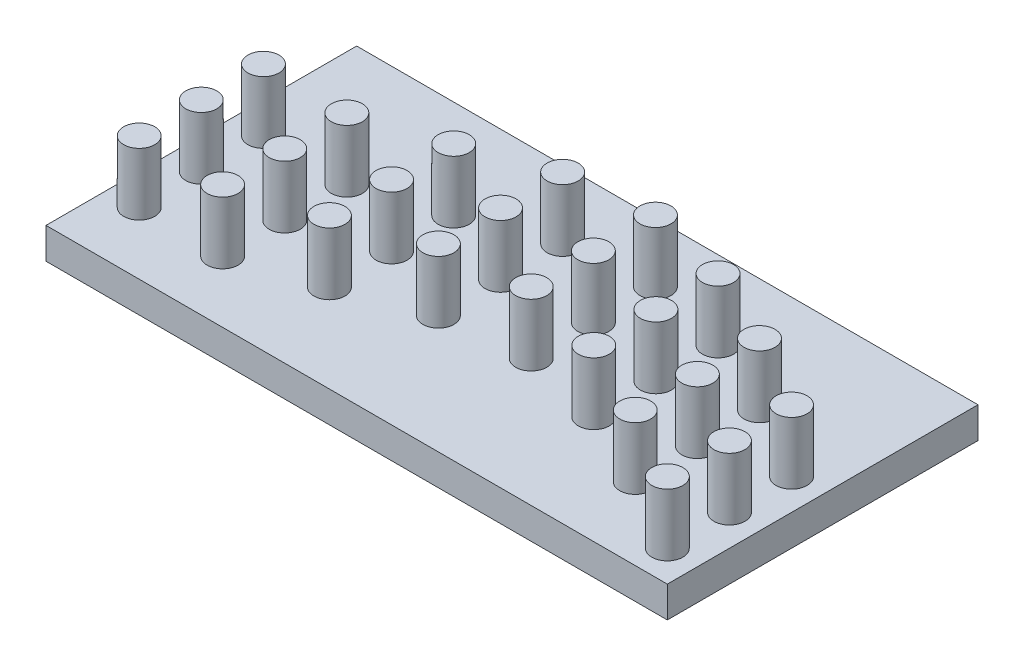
ISO-10303-21;
HEADER;
FILE_DESCRIPTION(('STEP AP214'),'2;1');
FILE_NAME('part.step','',(''),(''),'','','');
FILE_SCHEMA(('AUTOMOTIVE_DESIGN { 1 0 10303 214 1 1 1 1 }'));
ENDSEC;
DATA;
#1=APPLICATION_CONTEXT('core data for automotive mechanical design processes');
#2=APPLICATION_PROTOCOL_DEFINITION('international standard','automotive_design',2000,#1);
#3=PRODUCT_CONTEXT('',#1,'mechanical');
#4=PRODUCT('Part','Part','',(#3));
#5=PRODUCT_RELATED_PRODUCT_CATEGORY('part','',(#4));
#6=PRODUCT_DEFINITION_FORMATION('','',#4);
#7=PRODUCT_DEFINITION_CONTEXT('part definition',#1,'design');
#8=PRODUCT_DEFINITION('design','',#6,#7);
#9=PRODUCT_DEFINITION_SHAPE('','',#8);
#10=(LENGTH_UNIT() NAMED_UNIT(*) SI_UNIT(.MILLI.,.METRE.));
#11=(NAMED_UNIT(*) PLANE_ANGLE_UNIT() SI_UNIT($,.RADIAN.));
#12=(NAMED_UNIT(*) SI_UNIT($,.STERADIAN.) SOLID_ANGLE_UNIT());
#13=UNCERTAINTY_MEASURE_WITH_UNIT(LENGTH_MEASURE(1.E-05),#10,'distance_accuracy_value','');
#14=(GEOMETRIC_REPRESENTATION_CONTEXT(3) GLOBAL_UNCERTAINTY_ASSIGNED_CONTEXT((#13)) GLOBAL_UNIT_ASSIGNED_CONTEXT((#10,
#11,#12)) REPRESENTATION_CONTEXT('',''));
#15=CARTESIAN_POINT('',(0.,0.,0.));
#16=DIRECTION('',(0.,0.,1.));
#17=DIRECTION('',(1.,0.,0.));
#18=AXIS2_PLACEMENT_3D('',#15,#16,#17);
#19=CARTESIAN_POINT('',(0.,5.,-50.));
#20=DIRECTION('',(0.,-1.,0.));
#21=DIRECTION('',(0.,0.,-1.));
#22=AXIS2_PLACEMENT_3D('',#19,#20,#21);
#23=PLANE('',#22);
#24=CARTESIAN_POINT('',(5.,5.,-19.99755859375));
#25=DIRECTION('',(0.,-1.,0.));
#26=DIRECTION('',(0.,0.,-1.));
#27=AXIS2_PLACEMENT_3D('',#24,#25,#26);
#28=CIRCLE('',#27,2.5);
#29=CARTESIAN_POINT('',(5.,5.,-22.49755859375));
#30=VERTEX_POINT('',#29);
#31=EDGE_CURVE('E44',#30,#30,#28,.F.);
#32=ORIENTED_EDGE('',*,*,#31,.F.);
#33=EDGE_LOOP('',(#32));
#34=FACE_BOUND('',#33,.T.);
#35=CARTESIAN_POINT('',(18.5076552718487,5.,-29.9126254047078));
#36=DIRECTION('',(0.,-1.,0.));
#37=DIRECTION('',(0.,0.,-1.));
#38=AXIS2_PLACEMENT_3D('',#35,#36,#37);
#39=CIRCLE('',#38,2.5);
#40=CARTESIAN_POINT('',(18.5076552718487,5.,-32.4126254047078));
#41=VERTEX_POINT('',#40);
#42=EDGE_CURVE('E178',#41,#41,#39,.F.);
#43=ORIENTED_EDGE('',*,*,#42,.F.);
#44=EDGE_LOOP('',(#43));
#45=FACE_BOUND('',#44,.T.);
#46=CARTESIAN_POINT('',(18.5076552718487,5.,-9.91750821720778));
#47=DIRECTION('',(0.,-1.,0.));
#48=DIRECTION('',(0.,0.,-1.));
#49=AXIS2_PLACEMENT_3D('',#46,#47,#48);
#50=CIRCLE('',#49,2.5);
#51=CARTESIAN_POINT('',(18.5076552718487,5.,-12.4175082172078));
#52=VERTEX_POINT('',#51);
#53=EDGE_CURVE('E172',#52,#52,#50,.F.);
#54=ORIENTED_EDGE('',*,*,#53,.F.);
#55=EDGE_LOOP('',(#54));
#56=FACE_BOUND('',#55,.T.);
#57=CARTESIAN_POINT('',(31.4104140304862,5.,-24.2070037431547));
#58=DIRECTION('',(0.,-1.,0.));
#59=DIRECTION('',(0.,0.,-1.));
#60=AXIS2_PLACEMENT_3D('',#57,#58,#59);
#61=CIRCLE('',#60,2.5);
#62=CARTESIAN_POINT('',(31.4104140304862,5.,-26.7070037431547));
#63=VERTEX_POINT('',#62);
#64=EDGE_CURVE('E166',#63,#63,#61,.F.);
#65=ORIENTED_EDGE('',*,*,#64,.F.);
#66=EDGE_LOOP('',(#65));
#67=FACE_BOUND('',#66,.T.);
#68=CARTESIAN_POINT('',(44.1361143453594,5.,-39.0157945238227));
#69=DIRECTION('',(0.,-1.,0.));
#70=DIRECTION('',(0.,0.,-1.));
#71=AXIS2_PLACEMENT_3D('',#68,#69,#70);
#72=CIRCLE('',#71,2.5);
#73=CARTESIAN_POINT('',(44.1361143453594,5.,-41.5157945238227));
#74=VERTEX_POINT('',#73);
#75=EDGE_CURVE('E160',#74,#74,#72,.F.);
#76=ORIENTED_EDGE('',*,*,#75,.F.);
#77=EDGE_LOOP('',(#76));
#78=FACE_BOUND('',#77,.T.);
#79=CARTESIAN_POINT('',(44.1361143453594,5.,-19.0206773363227));
#80=DIRECTION('',(0.,-1.,0.));
#81=DIRECTION('',(0.,0.,-1.));
#82=AXIS2_PLACEMENT_3D('',#79,#80,#81);
#83=CIRCLE('',#82,2.5);
#84=CARTESIAN_POINT('',(44.1361143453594,5.,-21.5206773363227));
#85=VERTEX_POINT('',#84);
#86=EDGE_CURVE('E154',#85,#85,#83,.F.);
#87=ORIENTED_EDGE('',*,*,#86,.F.);
#88=EDGE_LOOP('',(#87));
#89=FACE_BOUND('',#88,.T.);
#90=CARTESIAN_POINT('',(57.5808907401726,5.,-30.5124052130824));
#91=DIRECTION('',(0.,-1.,0.));
#92=DIRECTION('',(0.,0.,-1.));
#93=AXIS2_PLACEMENT_3D('',#90,#91,#92);
#94=CIRCLE('',#93,2.5);
#95=CARTESIAN_POINT('',(57.5808907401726,5.,-33.0124052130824));
#96=VERTEX_POINT('',#95);
#97=EDGE_CURVE('E148',#96,#96,#94,.F.);
#98=ORIENTED_EDGE('',*,*,#97,.F.);
#99=EDGE_LOOP('',(#98));
#100=FACE_BOUND('',#99,.T.);
#101=CARTESIAN_POINT('',(70.7857795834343,5.,-37.373901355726));
#102=DIRECTION('',(0.,-1.,0.));
#103=DIRECTION('',(0.,0.,-1.));
#104=AXIS2_PLACEMENT_3D('',#101,#102,#103);
#105=CIRCLE('',#104,2.5);
#106=CARTESIAN_POINT('',(70.7857795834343,5.,-39.873901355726));
#107=VERTEX_POINT('',#106);
#108=EDGE_CURVE('E142',#107,#107,#105,.F.);
#109=ORIENTED_EDGE('',*,*,#108,.F.);
#110=EDGE_LOOP('',(#109));
#111=FACE_BOUND('',#110,.T.);
#112=CARTESIAN_POINT('',(70.7857795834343,5.,-17.378784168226));
#113=DIRECTION('',(0.,-1.,0.));
#114=DIRECTION('',(0.,0.,-1.));
#115=AXIS2_PLACEMENT_3D('',#112,#113,#114);
#116=CIRCLE('',#115,2.5);
#117=CARTESIAN_POINT('',(70.7857795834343,5.,-19.878784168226));
#118=VERTEX_POINT('',#117);
#119=EDGE_CURVE('E136',#118,#118,#116,.F.);
#120=ORIENTED_EDGE('',*,*,#119,.F.);
#121=EDGE_LOOP('',(#120));
#122=FACE_BOUND('',#121,.T.);
#123=CARTESIAN_POINT('',(83.1511721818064,5.,-21.683277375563));
#124=DIRECTION('',(0.,-1.,0.));
#125=DIRECTION('',(0.,0.,-1.));
#126=AXIS2_PLACEMENT_3D('',#123,#124,#125);
#127=CIRCLE('',#126,2.5);
#128=CARTESIAN_POINT('',(83.1511721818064,5.,-24.1832773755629));
#129=VERTEX_POINT('',#128);
#130=EDGE_CURVE('E130',#129,#129,#127,.F.);
#131=ORIENTED_EDGE('',*,*,#130,.F.);
#132=EDGE_LOOP('',(#131));
#133=FACE_BOUND('',#132,.T.);
#134=CARTESIAN_POINT('',(95.,5.,-24.9951171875));
#135=DIRECTION('',(0.,-1.,0.));
#136=DIRECTION('',(0.,0.,-1.));
#137=AXIS2_PLACEMENT_3D('',#134,#135,#136);
#138=CIRCLE('',#137,2.5);
#139=CARTESIAN_POINT('',(95.,5.,-27.4951171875));
#140=VERTEX_POINT('',#139);
#141=EDGE_CURVE('E124',#140,#140,#138,.F.);
#142=ORIENTED_EDGE('',*,*,#141,.F.);
#143=EDGE_LOOP('',(#142));
#144=FACE_BOUND('',#143,.T.);
#145=CARTESIAN_POINT('',(95.,5.,-5.));
#146=DIRECTION('',(0.,-1.,0.));
#147=DIRECTION('',(0.,0.,-1.));
#148=AXIS2_PLACEMENT_3D('',#145,#146,#147);
#149=CIRCLE('',#148,2.5);
#150=CARTESIAN_POINT('',(95.,5.,-7.5));
#151=VERTEX_POINT('',#150);
#152=EDGE_CURVE('E94',#151,#151,#149,.F.);
#153=ORIENTED_EDGE('',*,*,#152,.F.);
#154=EDGE_LOOP('',(#153));
#155=FACE_BOUND('',#154,.T.);
#156=DIRECTION('',(0.,0.,1.));
#157=VECTOR('',#156,1.);
#158=CARTESIAN_POINT('',(0.,5.,0.));
#159=LINE('',#158,#157);
#160=CARTESIAN_POINT('',(0.,5.,-50.));
#161=VERTEX_POINT('',#160);
#162=CARTESIAN_POINT('',(0.,5.,0.));
#163=VERTEX_POINT('',#162);
#164=EDGE_CURVE('E109',#161,#163,#159,.T.);
#165=ORIENTED_EDGE('',*,*,#164,.T.);
#166=DIRECTION('',(1.,0.,0.));
#167=VECTOR('',#166,1.);
#168=CARTESIAN_POINT('',(0.,5.,0.));
#169=LINE('',#168,#167);
#170=CARTESIAN_POINT('',(100.,5.,0.));
#171=VERTEX_POINT('',#170);
#172=EDGE_CURVE('E91',#163,#171,#169,.T.);
#173=ORIENTED_EDGE('',*,*,#172,.T.);
#174=DIRECTION('',(0.,0.,-1.));
#175=VECTOR('',#174,1.);
#176=CARTESIAN_POINT('',(100.,5.,0.));
#177=LINE('',#176,#175);
#178=CARTESIAN_POINT('',(100.,5.,-50.));
#179=VERTEX_POINT('',#178);
#180=EDGE_CURVE('E56',#171,#179,#177,.T.);
#181=ORIENTED_EDGE('',*,*,#180,.T.);
#182=DIRECTION('',(-1.,0.,0.));
#183=VECTOR('',#182,1.);
#184=CARTESIAN_POINT('',(0.,5.,-50.));
#185=LINE('',#184,#183);
#186=EDGE_CURVE('E51',#179,#161,#185,.T.);
#187=ORIENTED_EDGE('',*,*,#186,.T.);
#188=EDGE_LOOP('',(#165,#173,#181,#187));
#189=FACE_BOUND('',#188,.T.);
#190=CARTESIAN_POINT('',(95.,5.,-14.99755859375));
#191=DIRECTION('',(0.,-1.,0.));
#192=DIRECTION('',(0.,0.,-1.));
#193=AXIS2_PLACEMENT_3D('',#190,#191,#192);
#194=CIRCLE('',#193,2.5);
#195=CARTESIAN_POINT('',(95.,5.,-17.49755859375));
#196=VERTEX_POINT('',#195);
#197=EDGE_CURVE('E121',#196,#196,#194,.F.);
#198=ORIENTED_EDGE('',*,*,#197,.F.);
#199=EDGE_LOOP('',(#198));
#200=FACE_BOUND('',#199,.T.);
#201=CARTESIAN_POINT('',(83.1511721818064,5.,-11.6857187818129));
#202=DIRECTION('',(0.,-1.,0.));
#203=DIRECTION('',(0.,0.,-1.));
#204=AXIS2_PLACEMENT_3D('',#201,#202,#203);
#205=CIRCLE('',#204,2.5);
#206=CARTESIAN_POINT('',(83.1511721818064,5.,-14.1857187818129));
#207=VERTEX_POINT('',#206);
#208=EDGE_CURVE('E127',#207,#207,#205,.F.);
#209=ORIENTED_EDGE('',*,*,#208,.F.);
#210=EDGE_LOOP('',(#209));
#211=FACE_BOUND('',#210,.T.);
#212=CARTESIAN_POINT('',(83.1511721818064,5.,-31.680835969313));
#213=DIRECTION('',(0.,-1.,0.));
#214=DIRECTION('',(0.,0.,-1.));
#215=AXIS2_PLACEMENT_3D('',#212,#213,#214);
#216=CIRCLE('',#215,2.5);
#217=CARTESIAN_POINT('',(83.1511721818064,5.,-34.180835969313));
#218=VERTEX_POINT('',#217);
#219=EDGE_CURVE('E133',#218,#218,#216,.F.);
#220=ORIENTED_EDGE('',*,*,#219,.F.);
#221=EDGE_LOOP('',(#220));
#222=FACE_BOUND('',#221,.T.);
#223=CARTESIAN_POINT('',(70.7857795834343,5.,-27.376342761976));
#224=DIRECTION('',(0.,-1.,0.));
#225=DIRECTION('',(0.,0.,-1.));
#226=AXIS2_PLACEMENT_3D('',#223,#224,#225);
#227=CIRCLE('',#226,2.5);
#228=CARTESIAN_POINT('',(70.7857795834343,5.,-29.876342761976));
#229=VERTEX_POINT('',#228);
#230=EDGE_CURVE('E139',#229,#229,#227,.F.);
#231=ORIENTED_EDGE('',*,*,#230,.F.);
#232=EDGE_LOOP('',(#231));
#233=FACE_BOUND('',#232,.T.);
#234=CARTESIAN_POINT('',(57.5808907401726,5.,-20.5148466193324));
#235=DIRECTION('',(0.,-1.,0.));
#236=DIRECTION('',(0.,0.,-1.));
#237=AXIS2_PLACEMENT_3D('',#234,#235,#236);
#238=CIRCLE('',#237,2.5);
#239=CARTESIAN_POINT('',(57.5808907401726,5.,-23.0148466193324));
#240=VERTEX_POINT('',#239);
#241=EDGE_CURVE('E145',#240,#240,#238,.F.);
#242=ORIENTED_EDGE('',*,*,#241,.F.);
#243=EDGE_LOOP('',(#242));
#244=FACE_BOUND('',#243,.T.);
#245=CARTESIAN_POINT('',(57.5808907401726,5.,-40.5099638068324));
#246=DIRECTION('',(0.,-1.,0.));
#247=DIRECTION('',(0.,0.,-1.));
#248=AXIS2_PLACEMENT_3D('',#245,#246,#247);
#249=CIRCLE('',#248,2.5);
#250=CARTESIAN_POINT('',(57.5808907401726,5.,-43.0099638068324));
#251=VERTEX_POINT('',#250);
#252=EDGE_CURVE('E151',#251,#251,#249,.F.);
#253=ORIENTED_EDGE('',*,*,#252,.F.);
#254=EDGE_LOOP('',(#253));
#255=FACE_BOUND('',#254,.T.);
#256=CARTESIAN_POINT('',(44.1361143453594,5.,-29.0182359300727));
#257=DIRECTION('',(0.,-1.,0.));
#258=DIRECTION('',(0.,0.,-1.));
#259=AXIS2_PLACEMENT_3D('',#256,#257,#258);
#260=CIRCLE('',#259,2.5);
#261=CARTESIAN_POINT('',(44.1361143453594,5.,-31.5182359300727));
#262=VERTEX_POINT('',#261);
#263=EDGE_CURVE('E157',#262,#262,#260,.F.);
#264=ORIENTED_EDGE('',*,*,#263,.F.);
#265=EDGE_LOOP('',(#264));
#266=FACE_BOUND('',#265,.T.);
#267=CARTESIAN_POINT('',(31.4104140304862,5.,-14.2094451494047));
#268=DIRECTION('',(0.,-1.,0.));
#269=DIRECTION('',(0.,0.,-1.));
#270=AXIS2_PLACEMENT_3D('',#267,#268,#269);
#271=CIRCLE('',#270,2.5);
#272=CARTESIAN_POINT('',(31.4104140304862,5.,-16.7094451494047));
#273=VERTEX_POINT('',#272);
#274=EDGE_CURVE('E163',#273,#273,#271,.F.);
#275=ORIENTED_EDGE('',*,*,#274,.F.);
#276=EDGE_LOOP('',(#275));
#277=FACE_BOUND('',#276,.T.);
#278=CARTESIAN_POINT('',(31.4104140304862,5.,-34.2045623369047));
#279=DIRECTION('',(0.,-1.,0.));
#280=DIRECTION('',(0.,0.,-1.));
#281=AXIS2_PLACEMENT_3D('',#278,#279,#280);
#282=CIRCLE('',#281,2.5);
#283=CARTESIAN_POINT('',(31.4104140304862,5.,-36.7045623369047));
#284=VERTEX_POINT('',#283);
#285=EDGE_CURVE('E169',#284,#284,#282,.F.);
#286=ORIENTED_EDGE('',*,*,#285,.F.);
#287=EDGE_LOOP('',(#286));
#288=FACE_BOUND('',#287,.T.);
#289=CARTESIAN_POINT('',(18.5076552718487,5.,-19.9150668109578));
#290=DIRECTION('',(0.,-1.,0.));
#291=DIRECTION('',(0.,0.,-1.));
#292=AXIS2_PLACEMENT_3D('',#289,#290,#291);
#293=CIRCLE('',#292,2.5);
#294=CARTESIAN_POINT('',(18.5076552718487,5.,-22.4150668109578));
#295=VERTEX_POINT('',#294);
#296=EDGE_CURVE('E175',#295,#295,#293,.F.);
#297=ORIENTED_EDGE('',*,*,#296,.F.);
#298=EDGE_LOOP('',(#297));
#299=FACE_BOUND('',#298,.T.);
#300=CARTESIAN_POINT('',(5.,5.,-10.));
#301=DIRECTION('',(0.,-1.,0.));
#302=DIRECTION('',(0.,0.,-1.));
#303=AXIS2_PLACEMENT_3D('',#300,#301,#302);
#304=CIRCLE('',#303,2.5);
#305=CARTESIAN_POINT('',(5.,5.,-12.5));
#306=VERTEX_POINT('',#305);
#307=EDGE_CURVE('E181',#306,#306,#304,.F.);
#308=ORIENTED_EDGE('',*,*,#307,.F.);
#309=EDGE_LOOP('',(#308));
#310=FACE_BOUND('',#309,.T.);
#311=CARTESIAN_POINT('',(5.,5.,-29.9951171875));
#312=DIRECTION('',(0.,-1.,0.));
#313=DIRECTION('',(0.,0.,-1.));
#314=AXIS2_PLACEMENT_3D('',#311,#312,#313);
#315=CIRCLE('',#314,2.5);
#316=CARTESIAN_POINT('',(5.,5.,-32.4951171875));
#317=VERTEX_POINT('',#316);
#318=EDGE_CURVE('E12',#317,#317,#315,.F.);
#319=ORIENTED_EDGE('',*,*,#318,.F.);
#320=EDGE_LOOP('',(#319));
#321=FACE_BOUND('',#320,.T.);
#322=ADVANCED_FACE('F36',(#34,#45,#56,#67,#78,#89,#100,#111,#122,#133,#144,#155,#189,#200,#211,
#222,#233,#244,#255,#266,#277,#288,#299,#310,#321),#23,.F.);
#323=CARTESIAN_POINT('',(0.,5.,0.));
#324=DIRECTION('',(1.,0.,0.));
#325=DIRECTION('',(0.,0.,-1.));
#326=AXIS2_PLACEMENT_3D('',#323,#324,#325);
#327=PLANE('',#326);
#328=DIRECTION('',(0.,0.,1.));
#329=VECTOR('',#328,1.);
#330=CARTESIAN_POINT('',(0.,0.,0.));
#331=LINE('',#330,#329);
#332=CARTESIAN_POINT('',(0.,0.,-50.));
#333=VERTEX_POINT('',#332);
#334=CARTESIAN_POINT('',(0.,0.,0.));
#335=VERTEX_POINT('',#334);
#336=EDGE_CURVE('E82',#333,#335,#331,.T.);
#337=ORIENTED_EDGE('',*,*,#336,.T.);
#338=DIRECTION('',(0.,-1.,0.));
#339=VECTOR('',#338,1.);
#340=CARTESIAN_POINT('',(0.,5.,0.));
#341=LINE('',#340,#339);
#342=EDGE_CURVE('E89',#163,#335,#341,.T.);
#343=ORIENTED_EDGE('',*,*,#342,.F.);
#344=ORIENTED_EDGE('',*,*,#164,.F.);
#345=DIRECTION('',(0.,-1.,0.));
#346=VECTOR('',#345,1.);
#347=CARTESIAN_POINT('',(0.,5.,-50.));
#348=LINE('',#347,#346);
#349=EDGE_CURVE('E98',#161,#333,#348,.T.);
#350=ORIENTED_EDGE('',*,*,#349,.T.);
#351=EDGE_LOOP('',(#337,#343,#344,#350));
#352=FACE_BOUND('',#351,.T.);
#353=ADVANCED_FACE('F38',(#352),#327,.F.);
#354=CARTESIAN_POINT('',(0.,5.,0.));
#355=DIRECTION('',(0.,0.,-1.));
#356=DIRECTION('',(-1.,0.,0.));
#357=AXIS2_PLACEMENT_3D('',#354,#355,#356);
#358=PLANE('',#357);
#359=DIRECTION('',(1.,0.,0.));
#360=VECTOR('',#359,1.);
#361=CARTESIAN_POINT('',(0.,0.,0.));
#362=LINE('',#361,#360);
#363=CARTESIAN_POINT('',(100.,0.,0.));
#364=VERTEX_POINT('',#363);
#365=EDGE_CURVE('E77',#335,#364,#362,.T.);
#366=ORIENTED_EDGE('',*,*,#365,.T.);
#367=DIRECTION('',(0.,-1.,0.));
#368=VECTOR('',#367,1.);
#369=CARTESIAN_POINT('',(100.,5.,0.));
#370=LINE('',#369,#368);
#371=EDGE_CURVE('E95',#171,#364,#370,.T.);
#372=ORIENTED_EDGE('',*,*,#371,.F.);
#373=ORIENTED_EDGE('',*,*,#172,.F.);
#374=ORIENTED_EDGE('',*,*,#342,.T.);
#375=EDGE_LOOP('',(#366,#372,#373,#374));
#376=FACE_BOUND('',#375,.T.);
#377=ADVANCED_FACE('F90',(#376),#358,.F.);
#378=CARTESIAN_POINT('',(100.,5.,0.));
#379=DIRECTION('',(-1.,0.,0.));
#380=DIRECTION('',(0.,0.,1.));
#381=AXIS2_PLACEMENT_3D('',#378,#379,#380);
#382=PLANE('',#381);
#383=DIRECTION('',(0.,0.,-1.));
#384=VECTOR('',#383,1.);
#385=CARTESIAN_POINT('',(100.,0.,0.));
#386=LINE('',#385,#384);
#387=CARTESIAN_POINT('',(100.,0.,-50.));
#388=VERTEX_POINT('',#387);
#389=EDGE_CURVE('E83',#364,#388,#386,.T.);
#390=ORIENTED_EDGE('',*,*,#389,.T.);
#391=DIRECTION('',(0.,-1.,0.));
#392=VECTOR('',#391,1.);
#393=CARTESIAN_POINT('',(100.,5.,-50.));
#394=LINE('',#393,#392);
#395=EDGE_CURVE('E115',#179,#388,#394,.T.);
#396=ORIENTED_EDGE('',*,*,#395,.F.);
#397=ORIENTED_EDGE('',*,*,#180,.F.);
#398=ORIENTED_EDGE('',*,*,#371,.T.);
#399=EDGE_LOOP('',(#390,#396,#397,#398));
#400=FACE_BOUND('',#399,.T.);
#401=ADVANCED_FACE('F437',(#400),#382,.F.);
#402=CARTESIAN_POINT('',(0.,5.,-50.));
#403=DIRECTION('',(0.,0.,1.));
#404=DIRECTION('',(1.,0.,0.));
#405=AXIS2_PLACEMENT_3D('',#402,#403,#404);
#406=PLANE('',#405);
#407=DIRECTION('',(-1.,0.,0.));
#408=VECTOR('',#407,1.);
#409=CARTESIAN_POINT('',(0.,0.,-50.));
#410=LINE('',#409,#408);
#411=EDGE_CURVE('E107',#388,#333,#410,.T.);
#412=ORIENTED_EDGE('',*,*,#411,.T.);
#413=ORIENTED_EDGE('',*,*,#349,.F.);
#414=ORIENTED_EDGE('',*,*,#186,.F.);
#415=ORIENTED_EDGE('',*,*,#395,.T.);
#416=EDGE_LOOP('',(#412,#413,#414,#415));
#417=FACE_BOUND('',#416,.T.);
#418=ADVANCED_FACE('F433',(#417),#406,.F.);
#419=CARTESIAN_POINT('',(0.,0.,-50.));
#420=DIRECTION('',(0.,-1.,0.));
#421=DIRECTION('',(0.,0.,-1.));
#422=AXIS2_PLACEMENT_3D('',#419,#420,#421);
#423=PLANE('',#422);
#424=ORIENTED_EDGE('',*,*,#336,.F.);
#425=ORIENTED_EDGE('',*,*,#411,.F.);
#426=ORIENTED_EDGE('',*,*,#389,.F.);
#427=ORIENTED_EDGE('',*,*,#365,.F.);
#428=EDGE_LOOP('',(#424,#425,#426,#427));
#429=FACE_BOUND('',#428,.T.);
#430=ADVANCED_FACE('F79',(#429),#423,.T.);
#431=CARTESIAN_POINT('',(95.,15.,-5.));
#432=DIRECTION('',(0.,-1.,0.));
#433=DIRECTION('',(0.,0.,-1.));
#434=AXIS2_PLACEMENT_3D('',#431,#432,#433);
#435=CYLINDRICAL_SURFACE('',#434,2.5);
#436=CARTESIAN_POINT('',(95.,15.,-5.));
#437=DIRECTION('',(0.,1.,0.));
#438=DIRECTION('',(0.,0.,1.));
#439=AXIS2_PLACEMENT_3D('',#436,#437,#438);
#440=CIRCLE('',#439,2.5);
#441=CARTESIAN_POINT('',(95.,15.,-2.5));
#442=VERTEX_POINT('',#441);
#443=EDGE_CURVE('E99',#442,#442,#440,.T.);
#444=ORIENTED_EDGE('',*,*,#443,.F.);
#445=EDGE_LOOP('',(#444));
#446=FACE_BOUND('',#445,.T.);
#447=ORIENTED_EDGE('',*,*,#152,.T.);
#448=EDGE_LOOP('',(#447));
#449=FACE_BOUND('',#448,.T.);
#450=ADVANCED_FACE('F427',(#446,#449),#435,.T.);
#451=CARTESIAN_POINT('',(95.,15.,-5.));
#452=DIRECTION('',(0.,1.,0.));
#453=DIRECTION('',(0.,0.,1.));
#454=AXIS2_PLACEMENT_3D('',#451,#452,#453);
#455=PLANE('',#454);
#456=ORIENTED_EDGE('',*,*,#443,.T.);
#457=EDGE_LOOP('',(#456));
#458=FACE_BOUND('',#457,.T.);
#459=ADVANCED_FACE('F423',(#458),#455,.T.);
#460=CARTESIAN_POINT('',(95.,15.,-14.99755859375));
#461=DIRECTION('',(0.,-1.,0.));
#462=DIRECTION('',(0.,0.,-1.));
#463=AXIS2_PLACEMENT_3D('',#460,#461,#462);
#464=CYLINDRICAL_SURFACE('',#463,2.5);
#465=CARTESIAN_POINT('',(95.,15.,-14.99755859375));
#466=DIRECTION('',(0.,1.,0.));
#467=DIRECTION('',(0.,0.,1.));
#468=AXIS2_PLACEMENT_3D('',#465,#466,#467);
#469=CIRCLE('',#468,2.5);
#470=CARTESIAN_POINT('',(95.,15.,-12.49755859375));
#471=VERTEX_POINT('',#470);
#472=EDGE_CURVE('E102',#471,#471,#469,.T.);
#473=ORIENTED_EDGE('',*,*,#472,.F.);
#474=EDGE_LOOP('',(#473));
#475=FACE_BOUND('',#474,.T.);
#476=ORIENTED_EDGE('',*,*,#197,.T.);
#477=EDGE_LOOP('',(#476));
#478=FACE_BOUND('',#477,.T.);
#479=ADVANCED_FACE('F419',(#475,#478),#464,.T.);
#480=CARTESIAN_POINT('',(95.,15.,-14.99755859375));
#481=DIRECTION('',(0.,1.,0.));
#482=DIRECTION('',(0.,0.,1.));
#483=AXIS2_PLACEMENT_3D('',#480,#481,#482);
#484=PLANE('',#483);
#485=ORIENTED_EDGE('',*,*,#472,.T.);
#486=EDGE_LOOP('',(#485));
#487=FACE_BOUND('',#486,.T.);
#488=ADVANCED_FACE('F415',(#487),#484,.T.);
#489=CARTESIAN_POINT('',(95.,15.,-24.9951171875));
#490=DIRECTION('',(0.,-1.,0.));
#491=DIRECTION('',(0.,0.,-1.));
#492=AXIS2_PLACEMENT_3D('',#489,#490,#491);
#493=CYLINDRICAL_SURFACE('',#492,2.5);
#494=CARTESIAN_POINT('',(95.,15.,-24.9951171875));
#495=DIRECTION('',(0.,1.,0.));
#496=DIRECTION('',(0.,0.,1.));
#497=AXIS2_PLACEMENT_3D('',#494,#495,#496);
#498=CIRCLE('',#497,2.5);
#499=CARTESIAN_POINT('',(95.,15.,-22.4951171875));
#500=VERTEX_POINT('',#499);
#501=EDGE_CURVE('E770',#500,#500,#498,.T.);
#502=ORIENTED_EDGE('',*,*,#501,.F.);
#503=EDGE_LOOP('',(#502));
#504=FACE_BOUND('',#503,.T.);
#505=ORIENTED_EDGE('',*,*,#141,.T.);
#506=EDGE_LOOP('',(#505));
#507=FACE_BOUND('',#506,.T.);
#508=ADVANCED_FACE('F411',(#504,#507),#493,.T.);
#509=CARTESIAN_POINT('',(95.,15.,-24.9951171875));
#510=DIRECTION('',(0.,1.,0.));
#511=DIRECTION('',(0.,0.,1.));
#512=AXIS2_PLACEMENT_3D('',#509,#510,#511);
#513=PLANE('',#512);
#514=ORIENTED_EDGE('',*,*,#501,.T.);
#515=EDGE_LOOP('',(#514));
#516=FACE_BOUND('',#515,.T.);
#517=ADVANCED_FACE('F407',(#516),#513,.T.);
#518=CARTESIAN_POINT('',(83.1511721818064,15.,-11.6857187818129));
#519=DIRECTION('',(0.,-1.,0.));
#520=DIRECTION('',(0.,0.,-1.));
#521=AXIS2_PLACEMENT_3D('',#518,#519,#520);
#522=CYLINDRICAL_SURFACE('',#521,2.5);
#523=CARTESIAN_POINT('',(83.1511721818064,15.,-11.6857187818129));
#524=DIRECTION('',(0.,1.,0.));
#525=DIRECTION('',(0.,0.,1.));
#526=AXIS2_PLACEMENT_3D('',#523,#524,#525);
#527=CIRCLE('',#526,2.5);
#528=CARTESIAN_POINT('',(83.1511721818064,15.,-9.18571878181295));
#529=VERTEX_POINT('',#528);
#530=EDGE_CURVE('E772',#529,#529,#527,.T.);
#531=ORIENTED_EDGE('',*,*,#530,.F.);
#532=EDGE_LOOP('',(#531));
#533=FACE_BOUND('',#532,.T.);
#534=ORIENTED_EDGE('',*,*,#208,.T.);
#535=EDGE_LOOP('',(#534));
#536=FACE_BOUND('',#535,.T.);
#537=ADVANCED_FACE('F403',(#533,#536),#522,.T.);
#538=CARTESIAN_POINT('',(83.1511721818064,15.,-11.6857187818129));
#539=DIRECTION('',(0.,1.,0.));
#540=DIRECTION('',(0.,0.,1.));
#541=AXIS2_PLACEMENT_3D('',#538,#539,#540);
#542=PLANE('',#541);
#543=ORIENTED_EDGE('',*,*,#530,.T.);
#544=EDGE_LOOP('',(#543));
#545=FACE_BOUND('',#544,.T.);
#546=ADVANCED_FACE('F399',(#545),#542,.T.);
#547=CARTESIAN_POINT('',(83.1511721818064,15.,-21.683277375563));
#548=DIRECTION('',(0.,-1.,0.));
#549=DIRECTION('',(0.,0.,-1.));
#550=AXIS2_PLACEMENT_3D('',#547,#548,#549);
#551=CYLINDRICAL_SURFACE('',#550,2.5);
#552=CARTESIAN_POINT('',(83.1511721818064,15.,-21.683277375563));
#553=DIRECTION('',(0.,1.,0.));
#554=DIRECTION('',(0.,0.,1.));
#555=AXIS2_PLACEMENT_3D('',#552,#553,#554);
#556=CIRCLE('',#555,2.5);
#557=CARTESIAN_POINT('',(83.1511721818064,15.,-19.183277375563));
#558=VERTEX_POINT('',#557);
#559=EDGE_CURVE('E777',#558,#558,#556,.T.);
#560=ORIENTED_EDGE('',*,*,#559,.F.);
#561=EDGE_LOOP('',(#560));
#562=FACE_BOUND('',#561,.T.);
#563=ORIENTED_EDGE('',*,*,#130,.T.);
#564=EDGE_LOOP('',(#563));
#565=FACE_BOUND('',#564,.T.);
#566=ADVANCED_FACE('F395',(#562,#565),#551,.T.);
#567=CARTESIAN_POINT('',(83.1511721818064,15.,-21.683277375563));
#568=DIRECTION('',(0.,1.,0.));
#569=DIRECTION('',(0.,0.,1.));
#570=AXIS2_PLACEMENT_3D('',#567,#568,#569);
#571=PLANE('',#570);
#572=ORIENTED_EDGE('',*,*,#559,.T.);
#573=EDGE_LOOP('',(#572));
#574=FACE_BOUND('',#573,.T.);
#575=ADVANCED_FACE('F391',(#574),#571,.T.);
#576=CARTESIAN_POINT('',(83.1511721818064,15.,-31.680835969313));
#577=DIRECTION('',(0.,-1.,0.));
#578=DIRECTION('',(0.,0.,-1.));
#579=AXIS2_PLACEMENT_3D('',#576,#577,#578);
#580=CYLINDRICAL_SURFACE('',#579,2.5);
#581=CARTESIAN_POINT('',(83.1511721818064,15.,-31.680835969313));
#582=DIRECTION('',(0.,1.,0.));
#583=DIRECTION('',(0.,0.,1.));
#584=AXIS2_PLACEMENT_3D('',#581,#582,#583);
#585=CIRCLE('',#584,2.5);
#586=CARTESIAN_POINT('',(83.1511721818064,15.,-29.180835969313));
#587=VERTEX_POINT('',#586);
#588=EDGE_CURVE('E780',#587,#587,#585,.T.);
#589=ORIENTED_EDGE('',*,*,#588,.F.);
#590=EDGE_LOOP('',(#589));
#591=FACE_BOUND('',#590,.T.);
#592=ORIENTED_EDGE('',*,*,#219,.T.);
#593=EDGE_LOOP('',(#592));
#594=FACE_BOUND('',#593,.T.);
#595=ADVANCED_FACE('F387',(#591,#594),#580,.T.);
#596=CARTESIAN_POINT('',(83.1511721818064,15.,-31.680835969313));
#597=DIRECTION('',(0.,1.,0.));
#598=DIRECTION('',(0.,0.,1.));
#599=AXIS2_PLACEMENT_3D('',#596,#597,#598);
#600=PLANE('',#599);
#601=ORIENTED_EDGE('',*,*,#588,.T.);
#602=EDGE_LOOP('',(#601));
#603=FACE_BOUND('',#602,.T.);
#604=ADVANCED_FACE('F383',(#603),#600,.T.);
#605=CARTESIAN_POINT('',(70.7857795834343,15.,-17.378784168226));
#606=DIRECTION('',(0.,-1.,0.));
#607=DIRECTION('',(0.,0.,-1.));
#608=AXIS2_PLACEMENT_3D('',#605,#606,#607);
#609=CYLINDRICAL_SURFACE('',#608,2.5);
#610=CARTESIAN_POINT('',(70.7857795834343,15.,-17.378784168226));
#611=DIRECTION('',(0.,1.,0.));
#612=DIRECTION('',(0.,0.,1.));
#613=AXIS2_PLACEMENT_3D('',#610,#611,#612);
#614=CIRCLE('',#613,2.5);
#615=CARTESIAN_POINT('',(70.7857795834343,15.,-14.878784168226));
#616=VERTEX_POINT('',#615);
#617=EDGE_CURVE('E783',#616,#616,#614,.T.);
#618=ORIENTED_EDGE('',*,*,#617,.F.);
#619=EDGE_LOOP('',(#618));
#620=FACE_BOUND('',#619,.T.);
#621=ORIENTED_EDGE('',*,*,#119,.T.);
#622=EDGE_LOOP('',(#621));
#623=FACE_BOUND('',#622,.T.);
#624=ADVANCED_FACE('F379',(#620,#623),#609,.T.);
#625=CARTESIAN_POINT('',(70.7857795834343,15.,-17.378784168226));
#626=DIRECTION('',(0.,1.,0.));
#627=DIRECTION('',(0.,0.,1.));
#628=AXIS2_PLACEMENT_3D('',#625,#626,#627);
#629=PLANE('',#628);
#630=ORIENTED_EDGE('',*,*,#617,.T.);
#631=EDGE_LOOP('',(#630));
#632=FACE_BOUND('',#631,.T.);
#633=ADVANCED_FACE('F375',(#632),#629,.T.);
#634=CARTESIAN_POINT('',(70.7857795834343,15.,-27.376342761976));
#635=DIRECTION('',(0.,-1.,0.));
#636=DIRECTION('',(0.,0.,-1.));
#637=AXIS2_PLACEMENT_3D('',#634,#635,#636);
#638=CYLINDRICAL_SURFACE('',#637,2.5);
#639=CARTESIAN_POINT('',(70.7857795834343,15.,-27.376342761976));
#640=DIRECTION('',(0.,1.,0.));
#641=DIRECTION('',(0.,0.,1.));
#642=AXIS2_PLACEMENT_3D('',#639,#640,#641);
#643=CIRCLE('',#642,2.5);
#644=CARTESIAN_POINT('',(70.7857795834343,15.,-24.876342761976));
#645=VERTEX_POINT('',#644);
#646=EDGE_CURVE('E786',#645,#645,#643,.T.);
#647=ORIENTED_EDGE('',*,*,#646,.F.);
#648=EDGE_LOOP('',(#647));
#649=FACE_BOUND('',#648,.T.);
#650=ORIENTED_EDGE('',*,*,#230,.T.);
#651=EDGE_LOOP('',(#650));
#652=FACE_BOUND('',#651,.T.);
#653=ADVANCED_FACE('F371',(#649,#652),#638,.T.);
#654=CARTESIAN_POINT('',(70.7857795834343,15.,-27.376342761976));
#655=DIRECTION('',(0.,1.,0.));
#656=DIRECTION('',(0.,0.,1.));
#657=AXIS2_PLACEMENT_3D('',#654,#655,#656);
#658=PLANE('',#657);
#659=ORIENTED_EDGE('',*,*,#646,.T.);
#660=EDGE_LOOP('',(#659));
#661=FACE_BOUND('',#660,.T.);
#662=ADVANCED_FACE('F367',(#661),#658,.T.);
#663=CARTESIAN_POINT('',(70.7857795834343,15.,-37.373901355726));
#664=DIRECTION('',(0.,-1.,0.));
#665=DIRECTION('',(0.,0.,-1.));
#666=AXIS2_PLACEMENT_3D('',#663,#664,#665);
#667=CYLINDRICAL_SURFACE('',#666,2.5);
#668=CARTESIAN_POINT('',(70.7857795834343,15.,-37.373901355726));
#669=DIRECTION('',(0.,1.,0.));
#670=DIRECTION('',(0.,0.,1.));
#671=AXIS2_PLACEMENT_3D('',#668,#669,#670);
#672=CIRCLE('',#671,2.5);
#673=CARTESIAN_POINT('',(70.7857795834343,15.,-34.873901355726));
#674=VERTEX_POINT('',#673);
#675=EDGE_CURVE('E789',#674,#674,#672,.T.);
#676=ORIENTED_EDGE('',*,*,#675,.F.);
#677=EDGE_LOOP('',(#676));
#678=FACE_BOUND('',#677,.T.);
#679=ORIENTED_EDGE('',*,*,#108,.T.);
#680=EDGE_LOOP('',(#679));
#681=FACE_BOUND('',#680,.T.);
#682=ADVANCED_FACE('F363',(#678,#681),#667,.T.);
#683=CARTESIAN_POINT('',(70.7857795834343,15.,-37.373901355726));
#684=DIRECTION('',(0.,1.,0.));
#685=DIRECTION('',(0.,0.,1.));
#686=AXIS2_PLACEMENT_3D('',#683,#684,#685);
#687=PLANE('',#686);
#688=ORIENTED_EDGE('',*,*,#675,.T.);
#689=EDGE_LOOP('',(#688));
#690=FACE_BOUND('',#689,.T.);
#691=ADVANCED_FACE('F359',(#690),#687,.T.);
#692=CARTESIAN_POINT('',(57.5808907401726,15.,-20.5148466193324));
#693=DIRECTION('',(0.,-1.,0.));
#694=DIRECTION('',(0.,0.,-1.));
#695=AXIS2_PLACEMENT_3D('',#692,#693,#694);
#696=CYLINDRICAL_SURFACE('',#695,2.5);
#697=CARTESIAN_POINT('',(57.5808907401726,15.,-20.5148466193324));
#698=DIRECTION('',(0.,1.,0.));
#699=DIRECTION('',(0.,0.,1.));
#700=AXIS2_PLACEMENT_3D('',#697,#698,#699);
#701=CIRCLE('',#700,2.5);
#702=CARTESIAN_POINT('',(57.5808907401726,15.,-18.0148466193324));
#703=VERTEX_POINT('',#702);
#704=EDGE_CURVE('E792',#703,#703,#701,.T.);
#705=ORIENTED_EDGE('',*,*,#704,.F.);
#706=EDGE_LOOP('',(#705));
#707=FACE_BOUND('',#706,.T.);
#708=ORIENTED_EDGE('',*,*,#241,.T.);
#709=EDGE_LOOP('',(#708));
#710=FACE_BOUND('',#709,.T.);
#711=ADVANCED_FACE('F355',(#707,#710),#696,.T.);
#712=CARTESIAN_POINT('',(57.5808907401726,15.,-20.5148466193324));
#713=DIRECTION('',(0.,1.,0.));
#714=DIRECTION('',(0.,0.,1.));
#715=AXIS2_PLACEMENT_3D('',#712,#713,#714);
#716=PLANE('',#715);
#717=ORIENTED_EDGE('',*,*,#704,.T.);
#718=EDGE_LOOP('',(#717));
#719=FACE_BOUND('',#718,.T.);
#720=ADVANCED_FACE('F351',(#719),#716,.T.);
#721=CARTESIAN_POINT('',(57.5808907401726,15.,-30.5124052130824));
#722=DIRECTION('',(0.,-1.,0.));
#723=DIRECTION('',(0.,0.,-1.));
#724=AXIS2_PLACEMENT_3D('',#721,#722,#723);
#725=CYLINDRICAL_SURFACE('',#724,2.5);
#726=CARTESIAN_POINT('',(57.5808907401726,15.,-30.5124052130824));
#727=DIRECTION('',(0.,1.,0.));
#728=DIRECTION('',(0.,0.,1.));
#729=AXIS2_PLACEMENT_3D('',#726,#727,#728);
#730=CIRCLE('',#729,2.5);
#731=CARTESIAN_POINT('',(57.5808907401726,15.,-28.0124052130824));
#732=VERTEX_POINT('',#731);
#733=EDGE_CURVE('E795',#732,#732,#730,.T.);
#734=ORIENTED_EDGE('',*,*,#733,.F.);
#735=EDGE_LOOP('',(#734));
#736=FACE_BOUND('',#735,.T.);
#737=ORIENTED_EDGE('',*,*,#97,.T.);
#738=EDGE_LOOP('',(#737));
#739=FACE_BOUND('',#738,.T.);
#740=ADVANCED_FACE('F347',(#736,#739),#725,.T.);
#741=CARTESIAN_POINT('',(57.5808907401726,15.,-30.5124052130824));
#742=DIRECTION('',(0.,1.,0.));
#743=DIRECTION('',(0.,0.,1.));
#744=AXIS2_PLACEMENT_3D('',#741,#742,#743);
#745=PLANE('',#744);
#746=ORIENTED_EDGE('',*,*,#733,.T.);
#747=EDGE_LOOP('',(#746));
#748=FACE_BOUND('',#747,.T.);
#749=ADVANCED_FACE('F343',(#748),#745,.T.);
#750=CARTESIAN_POINT('',(57.5808907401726,15.,-40.5099638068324));
#751=DIRECTION('',(0.,-1.,0.));
#752=DIRECTION('',(0.,0.,-1.));
#753=AXIS2_PLACEMENT_3D('',#750,#751,#752);
#754=CYLINDRICAL_SURFACE('',#753,2.5);
#755=CARTESIAN_POINT('',(57.5808907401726,15.,-40.5099638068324));
#756=DIRECTION('',(0.,1.,0.));
#757=DIRECTION('',(0.,0.,1.));
#758=AXIS2_PLACEMENT_3D('',#755,#756,#757);
#759=CIRCLE('',#758,2.5);
#760=CARTESIAN_POINT('',(57.5808907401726,15.,-38.0099638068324));
#761=VERTEX_POINT('',#760);
#762=EDGE_CURVE('E798',#761,#761,#759,.T.);
#763=ORIENTED_EDGE('',*,*,#762,.F.);
#764=EDGE_LOOP('',(#763));
#765=FACE_BOUND('',#764,.T.);
#766=ORIENTED_EDGE('',*,*,#252,.T.);
#767=EDGE_LOOP('',(#766));
#768=FACE_BOUND('',#767,.T.);
#769=ADVANCED_FACE('F339',(#765,#768),#754,.T.);
#770=CARTESIAN_POINT('',(57.5808907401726,15.,-40.5099638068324));
#771=DIRECTION('',(0.,1.,0.));
#772=DIRECTION('',(0.,0.,1.));
#773=AXIS2_PLACEMENT_3D('',#770,#771,#772);
#774=PLANE('',#773);
#775=ORIENTED_EDGE('',*,*,#762,.T.);
#776=EDGE_LOOP('',(#775));
#777=FACE_BOUND('',#776,.T.);
#778=ADVANCED_FACE('F335',(#777),#774,.T.);
#779=CARTESIAN_POINT('',(44.1361143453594,15.,-19.0206773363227));
#780=DIRECTION('',(0.,-1.,0.));
#781=DIRECTION('',(0.,0.,-1.));
#782=AXIS2_PLACEMENT_3D('',#779,#780,#781);
#783=CYLINDRICAL_SURFACE('',#782,2.5);
#784=CARTESIAN_POINT('',(44.1361143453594,15.,-19.0206773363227));
#785=DIRECTION('',(0.,1.,0.));
#786=DIRECTION('',(0.,0.,1.));
#787=AXIS2_PLACEMENT_3D('',#784,#785,#786);
#788=CIRCLE('',#787,2.5);
#789=CARTESIAN_POINT('',(44.1361143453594,15.,-16.5206773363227));
#790=VERTEX_POINT('',#789);
#791=EDGE_CURVE('E801',#790,#790,#788,.T.);
#792=ORIENTED_EDGE('',*,*,#791,.F.);
#793=EDGE_LOOP('',(#792));
#794=FACE_BOUND('',#793,.T.);
#795=ORIENTED_EDGE('',*,*,#86,.T.);
#796=EDGE_LOOP('',(#795));
#797=FACE_BOUND('',#796,.T.);
#798=ADVANCED_FACE('F331',(#794,#797),#783,.T.);
#799=CARTESIAN_POINT('',(44.1361143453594,15.,-19.0206773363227));
#800=DIRECTION('',(0.,1.,0.));
#801=DIRECTION('',(0.,0.,1.));
#802=AXIS2_PLACEMENT_3D('',#799,#800,#801);
#803=PLANE('',#802);
#804=ORIENTED_EDGE('',*,*,#791,.T.);
#805=EDGE_LOOP('',(#804));
#806=FACE_BOUND('',#805,.T.);
#807=ADVANCED_FACE('F327',(#806),#803,.T.);
#808=CARTESIAN_POINT('',(44.1361143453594,15.,-29.0182359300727));
#809=DIRECTION('',(0.,-1.,0.));
#810=DIRECTION('',(0.,0.,-1.));
#811=AXIS2_PLACEMENT_3D('',#808,#809,#810);
#812=CYLINDRICAL_SURFACE('',#811,2.5);
#813=CARTESIAN_POINT('',(44.1361143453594,15.,-29.0182359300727));
#814=DIRECTION('',(0.,1.,0.));
#815=DIRECTION('',(0.,0.,1.));
#816=AXIS2_PLACEMENT_3D('',#813,#814,#815);
#817=CIRCLE('',#816,2.5);
#818=CARTESIAN_POINT('',(44.1361143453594,15.,-26.5182359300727));
#819=VERTEX_POINT('',#818);
#820=EDGE_CURVE('E804',#819,#819,#817,.T.);
#821=ORIENTED_EDGE('',*,*,#820,.F.);
#822=EDGE_LOOP('',(#821));
#823=FACE_BOUND('',#822,.T.);
#824=ORIENTED_EDGE('',*,*,#263,.T.);
#825=EDGE_LOOP('',(#824));
#826=FACE_BOUND('',#825,.T.);
#827=ADVANCED_FACE('F323',(#823,#826),#812,.T.);
#828=CARTESIAN_POINT('',(44.1361143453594,15.,-29.0182359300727));
#829=DIRECTION('',(0.,1.,0.));
#830=DIRECTION('',(0.,0.,1.));
#831=AXIS2_PLACEMENT_3D('',#828,#829,#830);
#832=PLANE('',#831);
#833=ORIENTED_EDGE('',*,*,#820,.T.);
#834=EDGE_LOOP('',(#833));
#835=FACE_BOUND('',#834,.T.);
#836=ADVANCED_FACE('F319',(#835),#832,.T.);
#837=CARTESIAN_POINT('',(44.1361143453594,15.,-39.0157945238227));
#838=DIRECTION('',(0.,-1.,0.));
#839=DIRECTION('',(0.,0.,-1.));
#840=AXIS2_PLACEMENT_3D('',#837,#838,#839);
#841=CYLINDRICAL_SURFACE('',#840,2.5);
#842=CARTESIAN_POINT('',(44.1361143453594,15.,-39.0157945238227));
#843=DIRECTION('',(0.,1.,0.));
#844=DIRECTION('',(0.,0.,1.));
#845=AXIS2_PLACEMENT_3D('',#842,#843,#844);
#846=CIRCLE('',#845,2.5);
#847=CARTESIAN_POINT('',(44.1361143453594,15.,-36.5157945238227));
#848=VERTEX_POINT('',#847);
#849=EDGE_CURVE('E807',#848,#848,#846,.T.);
#850=ORIENTED_EDGE('',*,*,#849,.F.);
#851=EDGE_LOOP('',(#850));
#852=FACE_BOUND('',#851,.T.);
#853=ORIENTED_EDGE('',*,*,#75,.T.);
#854=EDGE_LOOP('',(#853));
#855=FACE_BOUND('',#854,.T.);
#856=ADVANCED_FACE('F315',(#852,#855),#841,.T.);
#857=CARTESIAN_POINT('',(44.1361143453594,15.,-39.0157945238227));
#858=DIRECTION('',(0.,1.,0.));
#859=DIRECTION('',(0.,0.,1.));
#860=AXIS2_PLACEMENT_3D('',#857,#858,#859);
#861=PLANE('',#860);
#862=ORIENTED_EDGE('',*,*,#849,.T.);
#863=EDGE_LOOP('',(#862));
#864=FACE_BOUND('',#863,.T.);
#865=ADVANCED_FACE('F311',(#864),#861,.T.);
#866=CARTESIAN_POINT('',(31.4104140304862,15.,-14.2094451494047));
#867=DIRECTION('',(0.,-1.,0.));
#868=DIRECTION('',(0.,0.,-1.));
#869=AXIS2_PLACEMENT_3D('',#866,#867,#868);
#870=CYLINDRICAL_SURFACE('',#869,2.5);
#871=CARTESIAN_POINT('',(31.4104140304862,15.,-14.2094451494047));
#872=DIRECTION('',(0.,1.,0.));
#873=DIRECTION('',(0.,0.,1.));
#874=AXIS2_PLACEMENT_3D('',#871,#872,#873);
#875=CIRCLE('',#874,2.5);
#876=CARTESIAN_POINT('',(31.4104140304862,15.,-11.7094451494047));
#877=VERTEX_POINT('',#876);
#878=EDGE_CURVE('E810',#877,#877,#875,.T.);
#879=ORIENTED_EDGE('',*,*,#878,.F.);
#880=EDGE_LOOP('',(#879));
#881=FACE_BOUND('',#880,.T.);
#882=ORIENTED_EDGE('',*,*,#274,.T.);
#883=EDGE_LOOP('',(#882));
#884=FACE_BOUND('',#883,.T.);
#885=ADVANCED_FACE('F307',(#881,#884),#870,.T.);
#886=CARTESIAN_POINT('',(31.4104140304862,15.,-14.2094451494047));
#887=DIRECTION('',(0.,1.,0.));
#888=DIRECTION('',(0.,0.,1.));
#889=AXIS2_PLACEMENT_3D('',#886,#887,#888);
#890=PLANE('',#889);
#891=ORIENTED_EDGE('',*,*,#878,.T.);
#892=EDGE_LOOP('',(#891));
#893=FACE_BOUND('',#892,.T.);
#894=ADVANCED_FACE('F303',(#893),#890,.T.);
#895=CARTESIAN_POINT('',(31.4104140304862,15.,-24.2070037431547));
#896=DIRECTION('',(0.,-1.,0.));
#897=DIRECTION('',(0.,0.,-1.));
#898=AXIS2_PLACEMENT_3D('',#895,#896,#897);
#899=CYLINDRICAL_SURFACE('',#898,2.5);
#900=CARTESIAN_POINT('',(31.4104140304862,15.,-24.2070037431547));
#901=DIRECTION('',(0.,1.,0.));
#902=DIRECTION('',(0.,0.,1.));
#903=AXIS2_PLACEMENT_3D('',#900,#901,#902);
#904=CIRCLE('',#903,2.5);
#905=CARTESIAN_POINT('',(31.4104140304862,15.,-21.7070037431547));
#906=VERTEX_POINT('',#905);
#907=EDGE_CURVE('E813',#906,#906,#904,.T.);
#908=ORIENTED_EDGE('',*,*,#907,.F.);
#909=EDGE_LOOP('',(#908));
#910=FACE_BOUND('',#909,.T.);
#911=ORIENTED_EDGE('',*,*,#64,.T.);
#912=EDGE_LOOP('',(#911));
#913=FACE_BOUND('',#912,.T.);
#914=ADVANCED_FACE('F299',(#910,#913),#899,.T.);
#915=CARTESIAN_POINT('',(31.4104140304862,15.,-24.2070037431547));
#916=DIRECTION('',(0.,1.,0.));
#917=DIRECTION('',(0.,0.,1.));
#918=AXIS2_PLACEMENT_3D('',#915,#916,#917);
#919=PLANE('',#918);
#920=ORIENTED_EDGE('',*,*,#907,.T.);
#921=EDGE_LOOP('',(#920));
#922=FACE_BOUND('',#921,.T.);
#923=ADVANCED_FACE('F295',(#922),#919,.T.);
#924=CARTESIAN_POINT('',(31.4104140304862,15.,-34.2045623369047));
#925=DIRECTION('',(0.,-1.,0.));
#926=DIRECTION('',(0.,0.,-1.));
#927=AXIS2_PLACEMENT_3D('',#924,#925,#926);
#928=CYLINDRICAL_SURFACE('',#927,2.5);
#929=CARTESIAN_POINT('',(31.4104140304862,15.,-34.2045623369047));
#930=DIRECTION('',(0.,1.,0.));
#931=DIRECTION('',(0.,0.,1.));
#932=AXIS2_PLACEMENT_3D('',#929,#930,#931);
#933=CIRCLE('',#932,2.5);
#934=CARTESIAN_POINT('',(31.4104140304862,15.,-31.7045623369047));
#935=VERTEX_POINT('',#934);
#936=EDGE_CURVE('E816',#935,#935,#933,.T.);
#937=ORIENTED_EDGE('',*,*,#936,.F.);
#938=EDGE_LOOP('',(#937));
#939=FACE_BOUND('',#938,.T.);
#940=ORIENTED_EDGE('',*,*,#285,.T.);
#941=EDGE_LOOP('',(#940));
#942=FACE_BOUND('',#941,.T.);
#943=ADVANCED_FACE('F291',(#939,#942),#928,.T.);
#944=CARTESIAN_POINT('',(31.4104140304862,15.,-34.2045623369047));
#945=DIRECTION('',(0.,1.,0.));
#946=DIRECTION('',(0.,0.,1.));
#947=AXIS2_PLACEMENT_3D('',#944,#945,#946);
#948=PLANE('',#947);
#949=ORIENTED_EDGE('',*,*,#936,.T.);
#950=EDGE_LOOP('',(#949));
#951=FACE_BOUND('',#950,.T.);
#952=ADVANCED_FACE('F287',(#951),#948,.T.);
#953=CARTESIAN_POINT('',(18.5076552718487,15.,-9.91750821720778));
#954=DIRECTION('',(0.,-1.,0.));
#955=DIRECTION('',(0.,0.,-1.));
#956=AXIS2_PLACEMENT_3D('',#953,#954,#955);
#957=CYLINDRICAL_SURFACE('',#956,2.5);
#958=CARTESIAN_POINT('',(18.5076552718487,15.,-9.91750821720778));
#959=DIRECTION('',(0.,1.,0.));
#960=DIRECTION('',(0.,0.,1.));
#961=AXIS2_PLACEMENT_3D('',#958,#959,#960);
#962=CIRCLE('',#961,2.5);
#963=CARTESIAN_POINT('',(18.5076552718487,15.,-7.41750821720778));
#964=VERTEX_POINT('',#963);
#965=EDGE_CURVE('E819',#964,#964,#962,.T.);
#966=ORIENTED_EDGE('',*,*,#965,.F.);
#967=EDGE_LOOP('',(#966));
#968=FACE_BOUND('',#967,.T.);
#969=ORIENTED_EDGE('',*,*,#53,.T.);
#970=EDGE_LOOP('',(#969));
#971=FACE_BOUND('',#970,.T.);
#972=ADVANCED_FACE('F283',(#968,#971),#957,.T.);
#973=CARTESIAN_POINT('',(18.5076552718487,15.,-9.91750821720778));
#974=DIRECTION('',(0.,1.,0.));
#975=DIRECTION('',(0.,0.,1.));
#976=AXIS2_PLACEMENT_3D('',#973,#974,#975);
#977=PLANE('',#976);
#978=ORIENTED_EDGE('',*,*,#965,.T.);
#979=EDGE_LOOP('',(#978));
#980=FACE_BOUND('',#979,.T.);
#981=ADVANCED_FACE('F279',(#980),#977,.T.);
#982=CARTESIAN_POINT('',(18.5076552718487,15.,-19.9150668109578));
#983=DIRECTION('',(0.,-1.,0.));
#984=DIRECTION('',(0.,0.,-1.));
#985=AXIS2_PLACEMENT_3D('',#982,#983,#984);
#986=CYLINDRICAL_SURFACE('',#985,2.5);
#987=CARTESIAN_POINT('',(18.5076552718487,15.,-19.9150668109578));
#988=DIRECTION('',(0.,1.,0.));
#989=DIRECTION('',(0.,0.,1.));
#990=AXIS2_PLACEMENT_3D('',#987,#988,#989);
#991=CIRCLE('',#990,2.5);
#992=CARTESIAN_POINT('',(18.5076552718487,15.,-17.4150668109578));
#993=VERTEX_POINT('',#992);
#994=EDGE_CURVE('E822',#993,#993,#991,.T.);
#995=ORIENTED_EDGE('',*,*,#994,.F.);
#996=EDGE_LOOP('',(#995));
#997=FACE_BOUND('',#996,.T.);
#998=ORIENTED_EDGE('',*,*,#296,.T.);
#999=EDGE_LOOP('',(#998));
#1000=FACE_BOUND('',#999,.T.);
#1001=ADVANCED_FACE('F275',(#997,#1000),#986,.T.);
#1002=CARTESIAN_POINT('',(18.5076552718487,15.,-19.9150668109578));
#1003=DIRECTION('',(0.,1.,0.));
#1004=DIRECTION('',(0.,0.,1.));
#1005=AXIS2_PLACEMENT_3D('',#1002,#1003,#1004);
#1006=PLANE('',#1005);
#1007=ORIENTED_EDGE('',*,*,#994,.T.);
#1008=EDGE_LOOP('',(#1007));
#1009=FACE_BOUND('',#1008,.T.);
#1010=ADVANCED_FACE('F271',(#1009),#1006,.T.);
#1011=CARTESIAN_POINT('',(18.5076552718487,15.,-29.9126254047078));
#1012=DIRECTION('',(0.,-1.,0.));
#1013=DIRECTION('',(0.,0.,-1.));
#1014=AXIS2_PLACEMENT_3D('',#1011,#1012,#1013);
#1015=CYLINDRICAL_SURFACE('',#1014,2.5);
#1016=CARTESIAN_POINT('',(18.5076552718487,15.,-29.9126254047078));
#1017=DIRECTION('',(0.,1.,0.));
#1018=DIRECTION('',(0.,0.,1.));
#1019=AXIS2_PLACEMENT_3D('',#1016,#1017,#1018);
#1020=CIRCLE('',#1019,2.5);
#1021=CARTESIAN_POINT('',(18.5076552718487,15.,-27.4126254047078));
#1022=VERTEX_POINT('',#1021);
#1023=EDGE_CURVE('E825',#1022,#1022,#1020,.T.);
#1024=ORIENTED_EDGE('',*,*,#1023,.F.);
#1025=EDGE_LOOP('',(#1024));
#1026=FACE_BOUND('',#1025,.T.);
#1027=ORIENTED_EDGE('',*,*,#42,.T.);
#1028=EDGE_LOOP('',(#1027));
#1029=FACE_BOUND('',#1028,.T.);
#1030=ADVANCED_FACE('F267',(#1026,#1029),#1015,.T.);
#1031=CARTESIAN_POINT('',(18.5076552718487,15.,-29.9126254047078));
#1032=DIRECTION('',(0.,1.,0.));
#1033=DIRECTION('',(0.,0.,1.));
#1034=AXIS2_PLACEMENT_3D('',#1031,#1032,#1033);
#1035=PLANE('',#1034);
#1036=ORIENTED_EDGE('',*,*,#1023,.T.);
#1037=EDGE_LOOP('',(#1036));
#1038=FACE_BOUND('',#1037,.T.);
#1039=ADVANCED_FACE('F263',(#1038),#1035,.T.);
#1040=CARTESIAN_POINT('',(5.,15.,-10.));
#1041=DIRECTION('',(0.,-1.,0.));
#1042=DIRECTION('',(0.,0.,-1.));
#1043=AXIS2_PLACEMENT_3D('',#1040,#1041,#1042);
#1044=CYLINDRICAL_SURFACE('',#1043,2.5);
#1045=CARTESIAN_POINT('',(5.,15.,-10.));
#1046=DIRECTION('',(0.,1.,0.));
#1047=DIRECTION('',(0.,0.,1.));
#1048=AXIS2_PLACEMENT_3D('',#1045,#1046,#1047);
#1049=CIRCLE('',#1048,2.5);
#1050=CARTESIAN_POINT('',(5.,15.,-7.50000000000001));
#1051=VERTEX_POINT('',#1050);
#1052=EDGE_CURVE('E828',#1051,#1051,#1049,.T.);
#1053=ORIENTED_EDGE('',*,*,#1052,.F.);
#1054=EDGE_LOOP('',(#1053));
#1055=FACE_BOUND('',#1054,.T.);
#1056=ORIENTED_EDGE('',*,*,#307,.T.);
#1057=EDGE_LOOP('',(#1056));
#1058=FACE_BOUND('',#1057,.T.);
#1059=ADVANCED_FACE('F259',(#1055,#1058),#1044,.T.);
#1060=CARTESIAN_POINT('',(5.,15.,-10.));
#1061=DIRECTION('',(0.,1.,0.));
#1062=DIRECTION('',(0.,0.,1.));
#1063=AXIS2_PLACEMENT_3D('',#1060,#1061,#1062);
#1064=PLANE('',#1063);
#1065=ORIENTED_EDGE('',*,*,#1052,.T.);
#1066=EDGE_LOOP('',(#1065));
#1067=FACE_BOUND('',#1066,.T.);
#1068=ADVANCED_FACE('F255',(#1067),#1064,.T.);
#1069=CARTESIAN_POINT('',(5.,15.,-19.99755859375));
#1070=DIRECTION('',(0.,-1.,0.));
#1071=DIRECTION('',(0.,0.,-1.));
#1072=AXIS2_PLACEMENT_3D('',#1069,#1070,#1071);
#1073=CYLINDRICAL_SURFACE('',#1072,2.5);
#1074=CARTESIAN_POINT('',(5.,15.,-19.99755859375));
#1075=DIRECTION('',(0.,1.,0.));
#1076=DIRECTION('',(0.,0.,1.));
#1077=AXIS2_PLACEMENT_3D('',#1074,#1075,#1076);
#1078=CIRCLE('',#1077,2.5);
#1079=CARTESIAN_POINT('',(5.,15.,-17.49755859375));
#1080=VERTEX_POINT('',#1079);
#1081=EDGE_CURVE('E831',#1080,#1080,#1078,.T.);
#1082=ORIENTED_EDGE('',*,*,#1081,.F.);
#1083=EDGE_LOOP('',(#1082));
#1084=FACE_BOUND('',#1083,.T.);
#1085=ORIENTED_EDGE('',*,*,#31,.T.);
#1086=EDGE_LOOP('',(#1085));
#1087=FACE_BOUND('',#1086,.T.);
#1088=ADVANCED_FACE('F186',(#1084,#1087),#1073,.T.);
#1089=CARTESIAN_POINT('',(5.,15.,-19.99755859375));
#1090=DIRECTION('',(0.,1.,0.));
#1091=DIRECTION('',(0.,0.,1.));
#1092=AXIS2_PLACEMENT_3D('',#1089,#1090,#1091);
#1093=PLANE('',#1092);
#1094=ORIENTED_EDGE('',*,*,#1081,.T.);
#1095=EDGE_LOOP('',(#1094));
#1096=FACE_BOUND('',#1095,.T.);
#1097=ADVANCED_FACE('F240',(#1096),#1093,.T.);
#1098=CARTESIAN_POINT('',(5.,15.,-29.9951171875));
#1099=DIRECTION('',(0.,-1.,0.));
#1100=DIRECTION('',(0.,0.,-1.));
#1101=AXIS2_PLACEMENT_3D('',#1098,#1099,#1100);
#1102=CYLINDRICAL_SURFACE('',#1101,2.5);
#1103=CARTESIAN_POINT('',(5.,15.,-29.9951171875));
#1104=DIRECTION('',(0.,1.,0.));
#1105=DIRECTION('',(0.,0.,1.));
#1106=AXIS2_PLACEMENT_3D('',#1103,#1104,#1105);
#1107=CIRCLE('',#1106,2.5);
#1108=CARTESIAN_POINT('',(5.,15.,-27.4951171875));
#1109=VERTEX_POINT('',#1108);
#1110=EDGE_CURVE('E834',#1109,#1109,#1107,.T.);
#1111=ORIENTED_EDGE('',*,*,#1110,.F.);
#1112=EDGE_LOOP('',(#1111));
#1113=FACE_BOUND('',#1112,.T.);
#1114=ORIENTED_EDGE('',*,*,#318,.T.);
#1115=EDGE_LOOP('',(#1114));
#1116=FACE_BOUND('',#1115,.T.);
#1117=ADVANCED_FACE('F237',(#1113,#1116),#1102,.T.);
#1118=CARTESIAN_POINT('',(5.,15.,-29.9951171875));
#1119=DIRECTION('',(0.,1.,0.));
#1120=DIRECTION('',(0.,0.,1.));
#1121=AXIS2_PLACEMENT_3D('',#1118,#1119,#1120);
#1122=PLANE('',#1121);
#1123=ORIENTED_EDGE('',*,*,#1110,.T.);
#1124=EDGE_LOOP('',(#1123));
#1125=FACE_BOUND('',#1124,.T.);
#1126=ADVANCED_FACE('F239',(#1125),#1122,.T.);
#1127=CLOSED_SHELL('',(#322,#353,#377,#401,#418,#430,#450,#459,#479,#488,#508,#517,#537,#546,
#566,#575,#595,#604,#624,#633,#653,#662,#682,#691,#711,#720,#740,#749,#769,#778,#798,#807,#827,
#836,#856,#865,#885,#894,#914,#923,#943,#952,#972,#981,#1001,#1010,#1030,#1039,#1059,#1068,
#1088,#1097,#1117,#1126));
#1128=MANIFOLD_SOLID_BREP('B2',#1127);
#1129=ADVANCED_BREP_SHAPE_REPRESENTATION('',(#18,#1128),#14);
#1130=SHAPE_DEFINITION_REPRESENTATION(#9,#1129);
ENDSEC;
END-ISO-10303-21;
